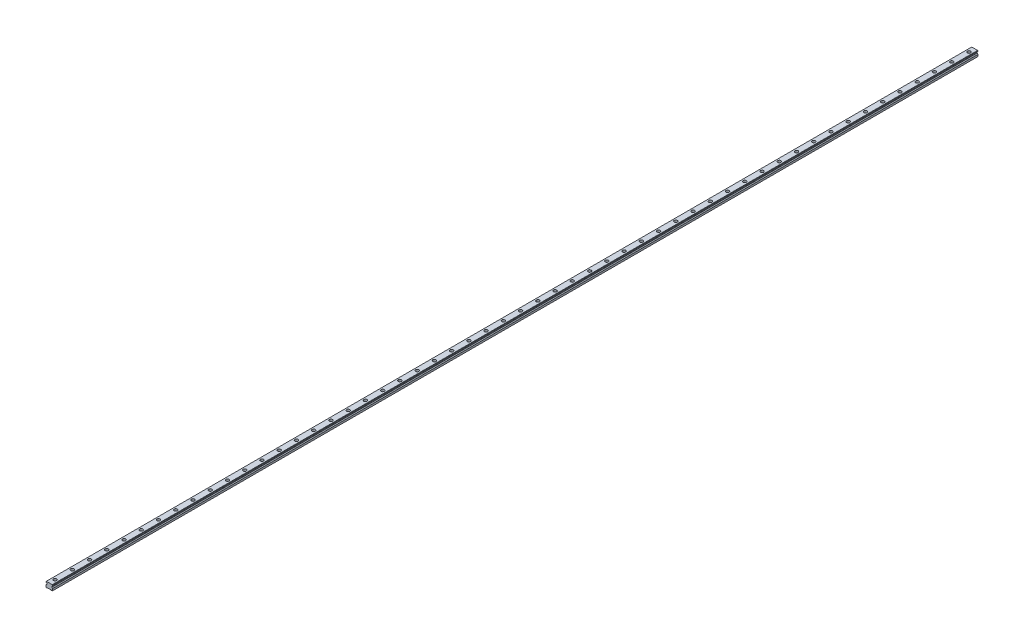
from build123d import *

# Parameters (mm, degrees)
SKETCH1_W           = 23
SKETCH1_H           = 19.2
BOSS_EXTRUDE1_DEPTH = 1610
CUT_EXTRUDE1_DEPTH  = 3221.077777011
CHAMFER1_SIZE       = 1.25
FILLET1_R           = 1.25
CUT_EXTRUDE2_DEPTH  = 3221.077777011
SKETCH4_R           = 5.5
SKETCH4_R_2         = 3.5
CUT_EXTRUDE3_DEPTH  = 9
SKETCH4_2_R         = 3.5
CUT_EXTRUDE4_DEPTH  = 1611.155548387
LPATTERN1_COUNT     = 54
LPATTERN1_PITCH     = 60


with BuildPart() as part:
    # Sketch1 → Boss-Extrude1 (new, symmetric)
    with BuildSketch(Plane.XY):
        with Locations((0, 9.6)):
            Rectangle(SKETCH1_W, SKETCH1_H)
    extrude(amount=BOSS_EXTRUDE1_DEPTH, both=True)

    # Sketch2 → Cut-Extrude1 (cut, through all)
    with BuildSketch(Plane.XY.offset(1610)):
        Polygon((-11.5, 16.7), (-11.5, 7.95), (-8.583333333, 10.866666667), (-8.583333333, 13.783333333), align=None)
        Polygon((8.583333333, 13.783333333), (11.5, 16.7), (11.5, 7.95), (8.583333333, 10.866666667), align=None)
    extrude(amount=-CUT_EXTRUDE1_DEPTH, mode=Mode.SUBTRACT)

    # Chamfer1
    chamfer1_edges = [part.edges().sort_by_distance(p)[0] for p in [
        (-11.5, 19.2, 0),
        (11.5, 19.2, 0),
        (11.5, 0, 0),
        (-11.5, 0, 0),
    ]]
    chamfer(chamfer1_edges, length=CHAMFER1_SIZE)

    # Fillet1
    fillet1_edges = [part.edges().sort_by_distance(p)[0] for p in [
        (-8.583333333, 13.783333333, 0),
        (-8.583333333, 10.866666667, 0),
        (8.583333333, 10.866666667, 0),
        (8.583333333, 13.783333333, 0),
    ]]
    fillet(fillet1_edges, radius=FILLET1_R)

    # Sketch3 → Cut-Extrude2 (cut, through all)
    with BuildSketch(Plane.XY.offset(1610)):
        Polygon((-7, 0), (-5.75, 1.25), (5.75, 1.25), (7, 0), align=None)
    extrude(amount=-CUT_EXTRUDE2_DEPTH, mode=Mode.SUBTRACT)

    # Sketch4 → Cut-Extrude3 (cut)
    with BuildSketch(Plane(origin=(0, 19.2, 0), x_dir=(1, 0, 0), z_dir=(0, 1, 0))):
        with Locations(Location((0, -1590, 0), (0, 0, 270))):
            Circle(SKETCH4_R)
        with Locations(Location((0, -1590, 0), (0, 0, 270))):
            Circle(SKETCH4_R_2, mode=Mode.SUBTRACT)
    cut_extrude3 = extrude(amount=-CUT_EXTRUDE3_DEPTH, mode=Mode.SUBTRACT)

    # Sketch4_2 → Cut-Extrude4 (cut, through all)
    with BuildSketch(Plane(origin=(0, 19.2, 0), x_dir=(1, 0, 0), z_dir=(0, 1, 0))):
        with Locations(Location((0, -1590, 0), (0, 0, 270))):
            Circle(SKETCH4_2_R)
    cut_extrude4 = extrude(amount=-CUT_EXTRUDE4_DEPTH, mode=Mode.SUBTRACT)

    # LPattern1: Cut-Extrude3, Cut-Extrude4 ×54
    with Locations(*[(0, 0, -i * LPATTERN1_PITCH) for i in range(1, LPATTERN1_COUNT)]):
        add(cut_extrude3, mode=Mode.SUBTRACT)
        add(cut_extrude4, mode=Mode.SUBTRACT)


solid = part.part
